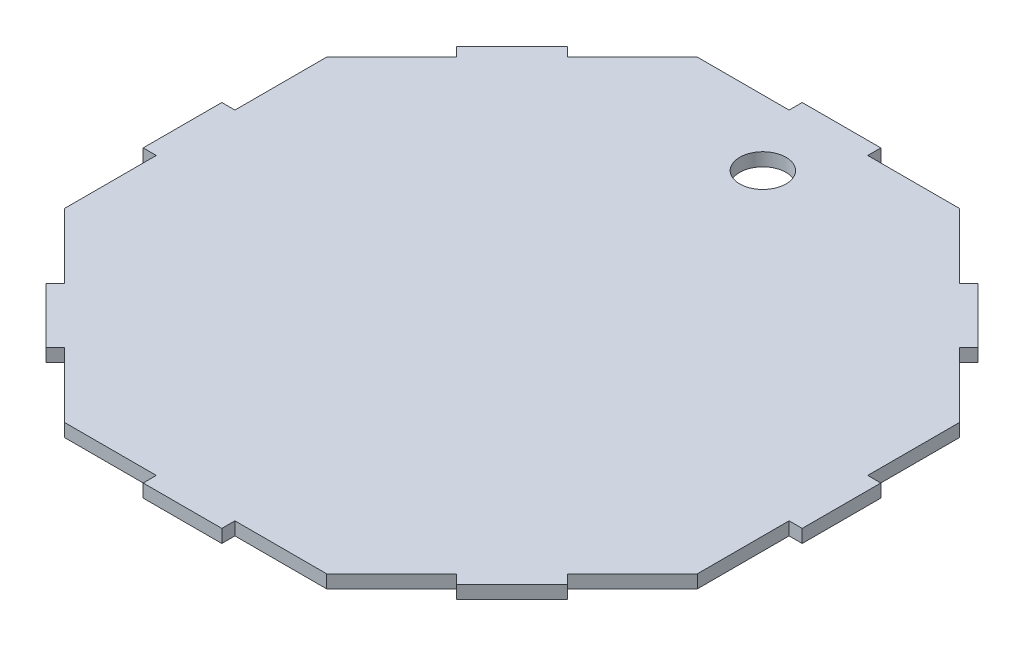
from build123d import *

# Parameters (mm, degrees)
CROQUIS1_R              = 8.828104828
SALIENTE_EXTRUIR1_DEPTH = 5


with BuildPart() as part:
    # Croquis1 → Saliente-Extruir1 (new body)
    with BuildSketch(Plane(origin=(0, 0, 0), x_dir=(1, 0, 0), z_dir=(0, 1, 0))):
        Polygon((-30.908981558, -85.661724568), (-30.908981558, -50.661724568), (-35.908981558, -50.661724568), (-35.908981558, -20.661724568), (-30.908981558, -20.661724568), (-30.908981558, 14.338275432), (-6.160244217, 39.087012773), (-9.695778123, 42.622546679), (11.517425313, 63.835750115), (15.052959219, 60.300216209), (39.80169656, 85.04895355), (74.80169656, 85.04895355), (74.80169656, 90.04895355), (104.80169656, 90.04895355), (104.80169656, 85.04895355), (139.80169656, 85.04895355), (164.550433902, 60.300216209), (168.085967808, 63.835750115), (189.299171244, 42.622546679), (185.763637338, 39.087012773), (210.512374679, 14.338275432), (210.512374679, -20.661724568), (215.512374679, -20.661724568), (215.512374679, -50.661724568), (210.512374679, -50.661724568), (210.512374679, -85.661724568), (185.763637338, -110.41046191), (189.299171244, -113.945995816), (168.085967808, -135.159199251), (164.550433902, -131.623665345), (139.80169656, -156.372402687), (104.80169656, -156.372402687), (104.80169656, -161.372402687), (74.80169656, -161.372402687), (74.80169656, -156.372402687), (39.80169656, -156.372402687), (15.052959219, -131.623665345), (11.517425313, -135.159199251), (-9.695778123, -113.945995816), (-6.160244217, -110.41046191), align=None)
        with Locations(Location((89.80169656, 60.04895355, 0), (0, 0, 270))):
            Circle(CROQUIS1_R, mode=Mode.SUBTRACT)
    extrude(amount=SALIENTE_EXTRUIR1_DEPTH)


solid = part.part
